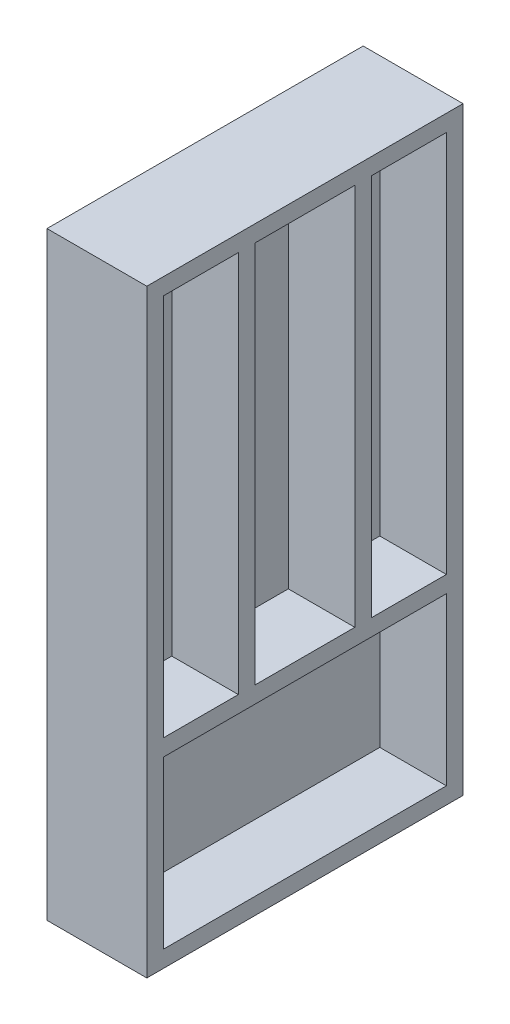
ISO-10303-21;
HEADER;
FILE_DESCRIPTION(('STEP AP214'),'2;1');
FILE_NAME('part.step','',(''),(''),'','','');
FILE_SCHEMA(('AUTOMOTIVE_DESIGN { 1 0 10303 214 1 1 1 1 }'));
ENDSEC;
DATA;
#1=APPLICATION_CONTEXT('core data for automotive mechanical design processes');
#2=APPLICATION_PROTOCOL_DEFINITION('international standard','automotive_design',2000,#1);
#3=PRODUCT_CONTEXT('',#1,'mechanical');
#4=PRODUCT('Part','Part','',(#3));
#5=PRODUCT_RELATED_PRODUCT_CATEGORY('part','',(#4));
#6=PRODUCT_DEFINITION_FORMATION('','',#4);
#7=PRODUCT_DEFINITION_CONTEXT('part definition',#1,'design');
#8=PRODUCT_DEFINITION('design','',#6,#7);
#9=PRODUCT_DEFINITION_SHAPE('','',#8);
#10=(LENGTH_UNIT() NAMED_UNIT(*) SI_UNIT(.MILLI.,.METRE.));
#11=(NAMED_UNIT(*) PLANE_ANGLE_UNIT() SI_UNIT($,.RADIAN.));
#12=(NAMED_UNIT(*) SI_UNIT($,.STERADIAN.) SOLID_ANGLE_UNIT());
#13=UNCERTAINTY_MEASURE_WITH_UNIT(LENGTH_MEASURE(1.E-05),#10,'distance_accuracy_value','');
#14=(GEOMETRIC_REPRESENTATION_CONTEXT(3) GLOBAL_UNCERTAINTY_ASSIGNED_CONTEXT((#13)) GLOBAL_UNIT_ASSIGNED_CONTEXT((#10,
#11,#12)) REPRESENTATION_CONTEXT('',''));
#15=CARTESIAN_POINT('',(0.,0.,0.));
#16=DIRECTION('',(0.,0.,1.));
#17=DIRECTION('',(1.,0.,0.));
#18=AXIS2_PLACEMENT_3D('',#15,#16,#17);
#19=CARTESIAN_POINT('',(50.8,25.4,25.4));
#20=DIRECTION('',(0.,0.,-1.));
#21=DIRECTION('',(-1.,0.,0.));
#22=AXIS2_PLACEMENT_3D('',#19,#20,#21);
#23=PLANE('',#22);
#24=DIRECTION('',(-1.,0.,0.));
#25=VECTOR('',#24,1.);
#26=CARTESIAN_POINT('',(152.4,304.8,25.4));
#27=LINE('',#26,#25);
#28=CARTESIAN_POINT('',(152.4,304.8,25.4));
#29=VERTEX_POINT('',#28);
#30=CARTESIAN_POINT('',(50.8,304.8,25.4));
#31=VERTEX_POINT('',#30);
#32=EDGE_CURVE('E371',#29,#31,#27,.T.);
#33=ORIENTED_EDGE('',*,*,#32,.F.);
#34=DIRECTION('',(0.,1.,0.));
#35=VECTOR('',#34,1.);
#36=CARTESIAN_POINT('',(152.4,25.4,25.4));
#37=LINE('',#36,#35);
#38=CARTESIAN_POINT('',(152.4,889.,25.4));
#39=VERTEX_POINT('',#38);
#40=EDGE_CURVE('E110',#29,#39,#37,.T.);
#41=ORIENTED_EDGE('',*,*,#40,.T.);
#42=DIRECTION('',(1.,0.,0.));
#43=VECTOR('',#42,1.);
#44=CARTESIAN_POINT('',(50.8,889.,25.4));
#45=LINE('',#44,#43);
#46=CARTESIAN_POINT('',(50.8,889.,25.4));
#47=VERTEX_POINT('',#46);
#48=EDGE_CURVE('E279',#47,#39,#45,.T.);
#49=ORIENTED_EDGE('',*,*,#48,.F.);
#50=DIRECTION('',(0.,1.,0.));
#51=VECTOR('',#50,1.);
#52=CARTESIAN_POINT('',(50.8,25.4,25.4));
#53=LINE('',#52,#51);
#54=EDGE_CURVE('E271',#31,#47,#53,.T.);
#55=ORIENTED_EDGE('',*,*,#54,.F.);
#56=EDGE_LOOP('',(#33,#41,#49,#55));
#57=FACE_BOUND('',#56,.T.);
#58=ADVANCED_FACE('F87',(#57),#23,.F.);
#59=CARTESIAN_POINT('',(50.8,889.,457.2));
#60=DIRECTION('',(0.,0.,1.));
#61=DIRECTION('',(1.,0.,0.));
#62=AXIS2_PLACEMENT_3D('',#59,#60,#61);
#63=PLANE('',#62);
#64=DIRECTION('',(-1.,0.,0.));
#65=VECTOR('',#64,1.);
#66=CARTESIAN_POINT('',(152.4,304.8,457.2));
#67=LINE('',#66,#65);
#68=CARTESIAN_POINT('',(152.4,304.8,457.2));
#69=VERTEX_POINT('',#68);
#70=CARTESIAN_POINT('',(50.8,304.8,457.2));
#71=VERTEX_POINT('',#70);
#72=EDGE_CURVE('E367',#69,#71,#67,.T.);
#73=ORIENTED_EDGE('',*,*,#72,.T.);
#74=DIRECTION('',(0.,-1.,0.));
#75=VECTOR('',#74,1.);
#76=CARTESIAN_POINT('',(50.8,889.,457.2));
#77=LINE('',#76,#75);
#78=CARTESIAN_POINT('',(50.8,889.,457.2));
#79=VERTEX_POINT('',#78);
#80=EDGE_CURVE('E414',#79,#71,#77,.T.);
#81=ORIENTED_EDGE('',*,*,#80,.F.);
#82=DIRECTION('',(1.,0.,0.));
#83=VECTOR('',#82,1.);
#84=CARTESIAN_POINT('',(50.8,889.,457.2));
#85=LINE('',#84,#83);
#86=CARTESIAN_POINT('',(152.4,889.,457.2));
#87=VERTEX_POINT('',#86);
#88=EDGE_CURVE('E277',#79,#87,#85,.T.);
#89=ORIENTED_EDGE('',*,*,#88,.T.);
#90=DIRECTION('',(0.,-1.,0.));
#91=VECTOR('',#90,1.);
#92=CARTESIAN_POINT('',(152.4,889.,457.2));
#93=LINE('',#92,#91);
#94=EDGE_CURVE('E248',#87,#69,#93,.T.);
#95=ORIENTED_EDGE('',*,*,#94,.T.);
#96=EDGE_LOOP('',(#73,#81,#89,#95));
#97=FACE_BOUND('',#96,.T.);
#98=ADVANCED_FACE('F333',(#97),#63,.F.);
#99=CARTESIAN_POINT('',(50.8,889.,25.4));
#100=DIRECTION('',(0.,1.,0.));
#101=DIRECTION('',(0.,0.,1.));
#102=AXIS2_PLACEMENT_3D('',#99,#100,#101);
#103=PLANE('',#102);
#104=DIRECTION('',(-1.,0.,0.));
#105=VECTOR('',#104,1.);
#106=CARTESIAN_POINT('',(152.4,889.,317.5));
#107=LINE('',#106,#105);
#108=CARTESIAN_POINT('',(152.4,889.,317.5));
#109=VERTEX_POINT('',#108);
#110=CARTESIAN_POINT('',(50.8,889.,317.5));
#111=VERTEX_POINT('',#110);
#112=EDGE_CURVE('E242',#109,#111,#107,.T.);
#113=ORIENTED_EDGE('',*,*,#112,.T.);
#114=DIRECTION('',(0.,0.,1.));
#115=VECTOR('',#114,1.);
#116=CARTESIAN_POINT('',(50.8,889.,25.4));
#117=LINE('',#116,#115);
#118=CARTESIAN_POINT('',(50.8,889.,165.1));
#119=VERTEX_POINT('',#118);
#120=EDGE_CURVE('E413',#119,#111,#117,.T.);
#121=ORIENTED_EDGE('',*,*,#120,.F.);
#122=DIRECTION('',(-1.,0.,0.));
#123=VECTOR('',#122,1.);
#124=CARTESIAN_POINT('',(152.4,889.,165.1));
#125=LINE('',#124,#123);
#126=CARTESIAN_POINT('',(152.4,889.,165.1));
#127=VERTEX_POINT('',#126);
#128=EDGE_CURVE('E396',#127,#119,#125,.T.);
#129=ORIENTED_EDGE('',*,*,#128,.F.);
#130=DIRECTION('',(0.,0.,1.));
#131=VECTOR('',#130,1.);
#132=CARTESIAN_POINT('',(152.4,889.,25.4));
#133=LINE('',#132,#131);
#134=EDGE_CURVE('E249',#127,#109,#133,.T.);
#135=ORIENTED_EDGE('',*,*,#134,.T.);
#136=EDGE_LOOP('',(#113,#121,#129,#135));
#137=FACE_BOUND('',#136,.T.);
#138=ADVANCED_FACE('F340',(#137),#103,.F.);
#139=DIRECTION('',(-1.,0.,0.));
#140=VECTOR('',#139,1.);
#141=CARTESIAN_POINT('',(152.4,889.,139.7));
#142=LINE('',#141,#140);
#143=CARTESIAN_POINT('',(152.4,889.,139.7));
#144=VERTEX_POINT('',#143);
#145=CARTESIAN_POINT('',(50.8,889.,139.7));
#146=VERTEX_POINT('',#145);
#147=EDGE_CURVE('E404',#144,#146,#142,.T.);
#148=ORIENTED_EDGE('',*,*,#147,.T.);
#149=EDGE_CURVE('E409',#47,#146,#117,.T.);
#150=ORIENTED_EDGE('',*,*,#149,.F.);
#151=ORIENTED_EDGE('',*,*,#48,.T.);
#152=EDGE_CURVE('E252',#39,#144,#133,.T.);
#153=ORIENTED_EDGE('',*,*,#152,.T.);
#154=EDGE_LOOP('',(#148,#150,#151,#153));
#155=FACE_BOUND('',#154,.T.);
#156=ADVANCED_FACE('F455',(#155),#103,.F.);
#157=CARTESIAN_POINT('',(50.8,0.,0.));
#158=DIRECTION('',(1.,0.,0.));
#159=DIRECTION('',(0.,0.,-1.));
#160=AXIS2_PLACEMENT_3D('',#157,#158,#159);
#161=PLANE('',#160);
#162=ORIENTED_EDGE('',*,*,#149,.T.);
#163=DIRECTION('',(0.,1.,0.));
#164=VECTOR('',#163,1.);
#165=CARTESIAN_POINT('',(50.8,304.8,139.7));
#166=LINE('',#165,#164);
#167=CARTESIAN_POINT('',(50.8,304.8,139.7));
#168=VERTEX_POINT('',#167);
#169=EDGE_CURVE('E394',#168,#146,#166,.T.);
#170=ORIENTED_EDGE('',*,*,#169,.F.);
#171=DIRECTION('',(0.,0.,1.));
#172=VECTOR('',#171,1.);
#173=CARTESIAN_POINT('',(50.8,304.8,25.4));
#174=LINE('',#173,#172);
#175=EDGE_CURVE('E378',#31,#168,#174,.T.);
#176=ORIENTED_EDGE('',*,*,#175,.F.);
#177=ORIENTED_EDGE('',*,*,#54,.T.);
#178=EDGE_LOOP('',(#162,#170,#176,#177));
#179=FACE_BOUND('',#178,.T.);
#180=ADVANCED_FACE('F453',(#179),#161,.T.);
#181=ORIENTED_EDGE('',*,*,#120,.T.);
#182=DIRECTION('',(0.,1.,0.));
#183=VECTOR('',#182,1.);
#184=CARTESIAN_POINT('',(50.8,304.8,317.5));
#185=LINE('',#184,#183);
#186=CARTESIAN_POINT('',(50.8,304.8,317.5));
#187=VERTEX_POINT('',#186);
#188=EDGE_CURVE('E233',#187,#111,#185,.T.);
#189=ORIENTED_EDGE('',*,*,#188,.F.);
#190=CARTESIAN_POINT('',(50.8,304.8,165.1));
#191=VERTEX_POINT('',#190);
#192=EDGE_CURVE('E382',#191,#187,#174,.T.);
#193=ORIENTED_EDGE('',*,*,#192,.F.);
#194=DIRECTION('',(0.,1.,0.));
#195=VECTOR('',#194,1.);
#196=CARTESIAN_POINT('',(50.8,304.8,165.1));
#197=LINE('',#196,#195);
#198=EDGE_CURVE('E397',#191,#119,#197,.T.);
#199=ORIENTED_EDGE('',*,*,#198,.T.);
#200=EDGE_LOOP('',(#181,#189,#193,#199));
#201=FACE_BOUND('',#200,.T.);
#202=ADVANCED_FACE('F464',(#201),#161,.T.);
#203=DIRECTION('',(0.,0.,1.));
#204=VECTOR('',#203,1.);
#205=CARTESIAN_POINT('',(50.8,279.4,25.4));
#206=LINE('',#205,#204);
#207=CARTESIAN_POINT('',(50.8,279.4,25.4));
#208=VERTEX_POINT('',#207);
#209=CARTESIAN_POINT('',(50.8,279.4,457.2));
#210=VERTEX_POINT('',#209);
#211=EDGE_CURVE('E381',#208,#210,#206,.T.);
#212=ORIENTED_EDGE('',*,*,#211,.T.);
#213=CARTESIAN_POINT('',(50.8,25.3999999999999,457.2));
#214=VERTEX_POINT('',#213);
#215=EDGE_CURVE('E412',#210,#214,#77,.T.);
#216=ORIENTED_EDGE('',*,*,#215,.T.);
#217=DIRECTION('',(0.,0.,-1.));
#218=VECTOR('',#217,1.);
#219=CARTESIAN_POINT('',(50.8,25.3999999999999,457.2));
#220=LINE('',#219,#218);
#221=CARTESIAN_POINT('',(50.8,25.4,25.4));
#222=VERTEX_POINT('',#221);
#223=EDGE_CURVE('E281',#214,#222,#220,.T.);
#224=ORIENTED_EDGE('',*,*,#223,.T.);
#225=EDGE_CURVE('E407',#222,#208,#53,.T.);
#226=ORIENTED_EDGE('',*,*,#225,.T.);
#227=EDGE_LOOP('',(#212,#216,#224,#226));
#228=FACE_BOUND('',#227,.T.);
#229=ADVANCED_FACE('F331',(#228),#161,.T.);
#230=CARTESIAN_POINT('',(152.4,0.,0.));
#231=DIRECTION('',(0.,1.,0.));
#232=DIRECTION('',(0.,0.,1.));
#233=AXIS2_PLACEMENT_3D('',#230,#231,#232);
#234=PLANE('',#233);
#235=DIRECTION('',(0.,0.,-1.));
#236=VECTOR('',#235,1.);
#237=CARTESIAN_POINT('',(0.,0.,0.));
#238=LINE('',#237,#236);
#239=CARTESIAN_POINT('',(0.,-1.11022302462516E-13,482.6));
#240=VERTEX_POINT('',#239);
#241=CARTESIAN_POINT('',(0.,0.,0.));
#242=VERTEX_POINT('',#241);
#243=EDGE_CURVE('E274',#240,#242,#238,.T.);
#244=ORIENTED_EDGE('',*,*,#243,.T.);
#245=DIRECTION('',(-1.,0.,0.));
#246=VECTOR('',#245,1.);
#247=CARTESIAN_POINT('',(152.4,0.,0.));
#248=LINE('',#247,#246);
#249=CARTESIAN_POINT('',(152.4,0.,0.));
#250=VERTEX_POINT('',#249);
#251=EDGE_CURVE('E12',#250,#242,#248,.T.);
#252=ORIENTED_EDGE('',*,*,#251,.F.);
#253=DIRECTION('',(0.,0.,-1.));
#254=VECTOR('',#253,1.);
#255=CARTESIAN_POINT('',(152.4,0.,0.));
#256=LINE('',#255,#254);
#257=CARTESIAN_POINT('',(152.4,-1.11022302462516E-13,482.6));
#258=VERTEX_POINT('',#257);
#259=EDGE_CURVE('E282',#258,#250,#256,.T.);
#260=ORIENTED_EDGE('',*,*,#259,.F.);
#261=DIRECTION('',(-1.,0.,0.));
#262=VECTOR('',#261,1.);
#263=CARTESIAN_POINT('',(152.4,-1.11022302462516E-13,482.6));
#264=LINE('',#263,#262);
#265=EDGE_CURVE('E292',#258,#240,#264,.T.);
#266=ORIENTED_EDGE('',*,*,#265,.T.);
#267=EDGE_LOOP('',(#244,#252,#260,#266));
#268=FACE_BOUND('',#267,.T.);
#269=ADVANCED_FACE('F89',(#268),#234,.F.);
#270=CARTESIAN_POINT('',(152.4,0.,0.));
#271=DIRECTION('',(0.,0.,1.));
#272=DIRECTION('',(1.,0.,0.));
#273=AXIS2_PLACEMENT_3D('',#270,#271,#272);
#274=PLANE('',#273);
#275=DIRECTION('',(0.,1.,0.));
#276=VECTOR('',#275,1.);
#277=CARTESIAN_POINT('',(0.,0.,0.));
#278=LINE('',#277,#276);
#279=CARTESIAN_POINT('',(0.,914.4,0.));
#280=VERTEX_POINT('',#279);
#281=EDGE_CURVE('E295',#242,#280,#278,.T.);
#282=ORIENTED_EDGE('',*,*,#281,.T.);
#283=DIRECTION('',(-1.,0.,0.));
#284=VECTOR('',#283,1.);
#285=CARTESIAN_POINT('',(152.4,914.4,0.));
#286=LINE('',#285,#284);
#287=CARTESIAN_POINT('',(152.4,914.4,0.));
#288=VERTEX_POINT('',#287);
#289=EDGE_CURVE('E95',#288,#280,#286,.T.);
#290=ORIENTED_EDGE('',*,*,#289,.F.);
#291=DIRECTION('',(0.,1.,0.));
#292=VECTOR('',#291,1.);
#293=CARTESIAN_POINT('',(152.4,0.,0.));
#294=LINE('',#293,#292);
#295=EDGE_CURVE('E285',#250,#288,#294,.T.);
#296=ORIENTED_EDGE('',*,*,#295,.F.);
#297=ORIENTED_EDGE('',*,*,#251,.T.);
#298=EDGE_LOOP('',(#282,#290,#296,#297));
#299=FACE_BOUND('',#298,.T.);
#300=ADVANCED_FACE('F324',(#299),#274,.F.);
#301=CARTESIAN_POINT('',(152.4,914.4,0.));
#302=DIRECTION('',(0.,-1.,0.));
#303=DIRECTION('',(0.,0.,-1.));
#304=AXIS2_PLACEMENT_3D('',#301,#302,#303);
#305=PLANE('',#304);
#306=DIRECTION('',(0.,0.,1.));
#307=VECTOR('',#306,1.);
#308=CARTESIAN_POINT('',(0.,914.4,0.));
#309=LINE('',#308,#307);
#310=CARTESIAN_POINT('',(0.,914.4,482.6));
#311=VERTEX_POINT('',#310);
#312=EDGE_CURVE('E297',#280,#311,#309,.T.);
#313=ORIENTED_EDGE('',*,*,#312,.T.);
#314=DIRECTION('',(-1.,0.,0.));
#315=VECTOR('',#314,1.);
#316=CARTESIAN_POINT('',(152.4,914.4,482.6));
#317=LINE('',#316,#315);
#318=CARTESIAN_POINT('',(152.4,914.4,482.6));
#319=VERTEX_POINT('',#318);
#320=EDGE_CURVE('E302',#319,#311,#317,.T.);
#321=ORIENTED_EDGE('',*,*,#320,.F.);
#322=DIRECTION('',(0.,0.,1.));
#323=VECTOR('',#322,1.);
#324=CARTESIAN_POINT('',(152.4,914.4,0.));
#325=LINE('',#324,#323);
#326=EDGE_CURVE('E288',#288,#319,#325,.T.);
#327=ORIENTED_EDGE('',*,*,#326,.F.);
#328=ORIENTED_EDGE('',*,*,#289,.T.);
#329=EDGE_LOOP('',(#313,#321,#327,#328));
#330=FACE_BOUND('',#329,.T.);
#331=ADVANCED_FACE('F309',(#330),#305,.F.);
#332=CARTESIAN_POINT('',(152.4,-1.11022302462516E-13,482.6));
#333=DIRECTION('',(0.,0.,-1.));
#334=DIRECTION('',(-1.,0.,0.));
#335=AXIS2_PLACEMENT_3D('',#332,#333,#334);
#336=PLANE('',#335);
#337=DIRECTION('',(0.,-1.,0.));
#338=VECTOR('',#337,1.);
#339=CARTESIAN_POINT('',(0.,-1.11022302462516E-13,482.6));
#340=LINE('',#339,#338);
#341=EDGE_CURVE('E286',#311,#240,#340,.T.);
#342=ORIENTED_EDGE('',*,*,#341,.T.);
#343=ORIENTED_EDGE('',*,*,#265,.F.);
#344=DIRECTION('',(0.,-1.,0.));
#345=VECTOR('',#344,1.);
#346=CARTESIAN_POINT('',(152.4,-1.11022302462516E-13,482.6));
#347=LINE('',#346,#345);
#348=EDGE_CURVE('E290',#319,#258,#347,.T.);
#349=ORIENTED_EDGE('',*,*,#348,.F.);
#350=ORIENTED_EDGE('',*,*,#320,.T.);
#351=EDGE_LOOP('',(#342,#343,#349,#350));
#352=FACE_BOUND('',#351,.T.);
#353=ADVANCED_FACE('F318',(#352),#336,.F.);
#354=CARTESIAN_POINT('',(152.4,0.,0.));
#355=DIRECTION('',(-1.,0.,0.));
#356=DIRECTION('',(0.,0.,1.));
#357=AXIS2_PLACEMENT_3D('',#354,#355,#356);
#358=PLANE('',#357);
#359=ORIENTED_EDGE('',*,*,#40,.F.);
#360=DIRECTION('',(0.,0.,1.));
#361=VECTOR('',#360,1.);
#362=CARTESIAN_POINT('',(152.4,304.8,25.4));
#363=LINE('',#362,#361);
#364=CARTESIAN_POINT('',(152.4,304.8,139.7));
#365=VERTEX_POINT('',#364);
#366=EDGE_CURVE('E368',#29,#365,#363,.T.);
#367=ORIENTED_EDGE('',*,*,#366,.T.);
#368=DIRECTION('',(0.,1.,0.));
#369=VECTOR('',#368,1.);
#370=CARTESIAN_POINT('',(152.4,304.8,139.7));
#371=LINE('',#370,#369);
#372=EDGE_CURVE('E393',#365,#144,#371,.T.);
#373=ORIENTED_EDGE('',*,*,#372,.T.);
#374=ORIENTED_EDGE('',*,*,#152,.F.);
#375=EDGE_LOOP('',(#359,#367,#373,#374));
#376=FACE_BOUND('',#375,.T.);
#377=CARTESIAN_POINT('',(152.4,304.8,342.9));
#378=VERTEX_POINT('',#377);
#379=EDGE_CURVE('E376',#378,#69,#363,.T.);
#380=ORIENTED_EDGE('',*,*,#379,.T.);
#381=ORIENTED_EDGE('',*,*,#94,.F.);
#382=CARTESIAN_POINT('',(152.4,889.,342.9));
#383=VERTEX_POINT('',#382);
#384=EDGE_CURVE('E239',#383,#87,#133,.T.);
#385=ORIENTED_EDGE('',*,*,#384,.F.);
#386=DIRECTION('',(0.,1.,0.));
#387=VECTOR('',#386,1.);
#388=CARTESIAN_POINT('',(152.4,304.8,342.9));
#389=LINE('',#388,#387);
#390=EDGE_CURVE('E224',#378,#383,#389,.T.);
#391=ORIENTED_EDGE('',*,*,#390,.F.);
#392=EDGE_LOOP('',(#380,#381,#385,#391));
#393=FACE_BOUND('',#392,.T.);
#394=CARTESIAN_POINT('',(152.4,279.4,457.2));
#395=VERTEX_POINT('',#394);
#396=CARTESIAN_POINT('',(152.4,25.3999999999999,457.2));
#397=VERTEX_POINT('',#396);
#398=EDGE_CURVE('E258',#395,#397,#93,.T.);
#399=ORIENTED_EDGE('',*,*,#398,.F.);
#400=DIRECTION('',(0.,0.,1.));
#401=VECTOR('',#400,1.);
#402=CARTESIAN_POINT('',(152.4,279.4,25.4));
#403=LINE('',#402,#401);
#404=CARTESIAN_POINT('',(152.4,279.4,25.4));
#405=VERTEX_POINT('',#404);
#406=EDGE_CURVE('E365',#405,#395,#403,.T.);
#407=ORIENTED_EDGE('',*,*,#406,.F.);
#408=CARTESIAN_POINT('',(152.4,25.4,25.4));
#409=VERTEX_POINT('',#408);
#410=EDGE_CURVE('E250',#409,#405,#37,.T.);
#411=ORIENTED_EDGE('',*,*,#410,.F.);
#412=DIRECTION('',(0.,0.,-1.));
#413=VECTOR('',#412,1.);
#414=CARTESIAN_POINT('',(152.4,25.3999999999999,457.2));
#415=LINE('',#414,#413);
#416=EDGE_CURVE('E267',#397,#409,#415,.T.);
#417=ORIENTED_EDGE('',*,*,#416,.F.);
#418=EDGE_LOOP('',(#399,#407,#411,#417));
#419=FACE_BOUND('',#418,.T.);
#420=DIRECTION('',(0.,1.,0.));
#421=VECTOR('',#420,1.);
#422=CARTESIAN_POINT('',(152.4,304.8,317.5));
#423=LINE('',#422,#421);
#424=CARTESIAN_POINT('',(152.4,304.8,317.5));
#425=VERTEX_POINT('',#424);
#426=EDGE_CURVE('E232',#425,#109,#423,.T.);
#427=ORIENTED_EDGE('',*,*,#426,.T.);
#428=ORIENTED_EDGE('',*,*,#134,.F.);
#429=DIRECTION('',(0.,1.,0.));
#430=VECTOR('',#429,1.);
#431=CARTESIAN_POINT('',(152.4,304.8,165.1));
#432=LINE('',#431,#430);
#433=CARTESIAN_POINT('',(152.4,304.8,165.1));
#434=VERTEX_POINT('',#433);
#435=EDGE_CURVE('E391',#434,#127,#432,.T.);
#436=ORIENTED_EDGE('',*,*,#435,.F.);
#437=EDGE_CURVE('E374',#434,#425,#363,.T.);
#438=ORIENTED_EDGE('',*,*,#437,.T.);
#439=EDGE_LOOP('',(#427,#428,#436,#438));
#440=FACE_BOUND('',#439,.T.);
#441=ORIENTED_EDGE('',*,*,#259,.T.);
#442=ORIENTED_EDGE('',*,*,#295,.T.);
#443=ORIENTED_EDGE('',*,*,#326,.T.);
#444=ORIENTED_EDGE('',*,*,#348,.T.);
#445=EDGE_LOOP('',(#441,#442,#443,#444));
#446=FACE_BOUND('',#445,.T.);
#447=ADVANCED_FACE('F245',(#376,#393,#419,#440,#446),#358,.F.);
#448=CARTESIAN_POINT('',(0.,0.,0.));
#449=DIRECTION('',(-1.,0.,0.));
#450=DIRECTION('',(0.,0.,1.));
#451=AXIS2_PLACEMENT_3D('',#448,#449,#450);
#452=PLANE('',#451);
#453=ORIENTED_EDGE('',*,*,#243,.F.);
#454=ORIENTED_EDGE('',*,*,#341,.F.);
#455=ORIENTED_EDGE('',*,*,#312,.F.);
#456=ORIENTED_EDGE('',*,*,#281,.F.);
#457=EDGE_LOOP('',(#453,#454,#455,#456));
#458=FACE_BOUND('',#457,.T.);
#459=ADVANCED_FACE('F315',(#458),#452,.T.);
#460=ORIENTED_EDGE('',*,*,#410,.T.);
#461=DIRECTION('',(-1.,0.,0.));
#462=VECTOR('',#461,1.);
#463=CARTESIAN_POINT('',(152.4,279.4,25.4));
#464=LINE('',#463,#462);
#465=EDGE_CURVE('E360',#405,#208,#464,.T.);
#466=ORIENTED_EDGE('',*,*,#465,.T.);
#467=ORIENTED_EDGE('',*,*,#225,.F.);
#468=DIRECTION('',(1.,0.,0.));
#469=VECTOR('',#468,1.);
#470=CARTESIAN_POINT('',(50.8,25.4,25.4));
#471=LINE('',#470,#469);
#472=EDGE_CURVE('E272',#222,#409,#471,.T.);
#473=ORIENTED_EDGE('',*,*,#472,.T.);
#474=EDGE_LOOP('',(#460,#466,#467,#473));
#475=FACE_BOUND('',#474,.T.);
#476=ADVANCED_FACE('F335',(#475),#23,.F.);
#477=CARTESIAN_POINT('',(50.8,25.3999999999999,457.2));
#478=DIRECTION('',(0.,-1.,0.));
#479=DIRECTION('',(0.,0.,-1.));
#480=AXIS2_PLACEMENT_3D('',#477,#478,#479);
#481=PLANE('',#480);
#482=ORIENTED_EDGE('',*,*,#416,.T.);
#483=ORIENTED_EDGE('',*,*,#472,.F.);
#484=ORIENTED_EDGE('',*,*,#223,.F.);
#485=DIRECTION('',(1.,0.,0.));
#486=VECTOR('',#485,1.);
#487=CARTESIAN_POINT('',(50.8,25.3999999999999,457.2));
#488=LINE('',#487,#486);
#489=EDGE_CURVE('E275',#214,#397,#488,.T.);
#490=ORIENTED_EDGE('',*,*,#489,.T.);
#491=EDGE_LOOP('',(#482,#483,#484,#490));
#492=FACE_BOUND('',#491,.T.);
#493=ADVANCED_FACE('F347',(#492),#481,.F.);
#494=ORIENTED_EDGE('',*,*,#215,.F.);
#495=DIRECTION('',(-1.,0.,0.));
#496=VECTOR('',#495,1.);
#497=CARTESIAN_POINT('',(152.4,279.4,457.2));
#498=LINE('',#497,#496);
#499=EDGE_CURVE('E386',#395,#210,#498,.T.);
#500=ORIENTED_EDGE('',*,*,#499,.F.);
#501=ORIENTED_EDGE('',*,*,#398,.T.);
#502=ORIENTED_EDGE('',*,*,#489,.F.);
#503=EDGE_LOOP('',(#494,#500,#501,#502));
#504=FACE_BOUND('',#503,.T.);
#505=ADVANCED_FACE('F343',(#504),#63,.F.);
#506=CARTESIAN_POINT('',(50.8,889.,342.9));
#507=VERTEX_POINT('',#506);
#508=EDGE_CURVE('E241',#507,#79,#117,.T.);
#509=ORIENTED_EDGE('',*,*,#508,.F.);
#510=DIRECTION('',(-1.,0.,0.));
#511=VECTOR('',#510,1.);
#512=CARTESIAN_POINT('',(152.4,889.,342.9));
#513=LINE('',#512,#511);
#514=EDGE_CURVE('E227',#383,#507,#513,.T.);
#515=ORIENTED_EDGE('',*,*,#514,.F.);
#516=ORIENTED_EDGE('',*,*,#384,.T.);
#517=ORIENTED_EDGE('',*,*,#88,.F.);
#518=EDGE_LOOP('',(#509,#515,#516,#517));
#519=FACE_BOUND('',#518,.T.);
#520=ADVANCED_FACE('F237',(#519),#103,.F.);
#521=DIRECTION('',(0.,1.,0.));
#522=VECTOR('',#521,1.);
#523=CARTESIAN_POINT('',(50.8,304.8,342.9));
#524=LINE('',#523,#522);
#525=CARTESIAN_POINT('',(50.8,304.8,342.9));
#526=VERTEX_POINT('',#525);
#527=EDGE_CURVE('E102',#526,#507,#524,.T.);
#528=ORIENTED_EDGE('',*,*,#527,.T.);
#529=ORIENTED_EDGE('',*,*,#508,.T.);
#530=ORIENTED_EDGE('',*,*,#80,.T.);
#531=EDGE_CURVE('E383',#526,#71,#174,.T.);
#532=ORIENTED_EDGE('',*,*,#531,.F.);
#533=EDGE_LOOP('',(#528,#529,#530,#532));
#534=FACE_BOUND('',#533,.T.);
#535=ADVANCED_FACE('F449',(#534),#161,.T.);
#536=CARTESIAN_POINT('',(152.4,304.8,317.5));
#537=DIRECTION('',(0.,0.,1.));
#538=DIRECTION('',(1.,0.,0.));
#539=AXIS2_PLACEMENT_3D('',#536,#537,#538);
#540=PLANE('',#539);
#541=ORIENTED_EDGE('',*,*,#188,.T.);
#542=ORIENTED_EDGE('',*,*,#112,.F.);
#543=ORIENTED_EDGE('',*,*,#426,.F.);
#544=DIRECTION('',(-1.,0.,0.));
#545=VECTOR('',#544,1.);
#546=CARTESIAN_POINT('',(152.4,304.8,317.5));
#547=LINE('',#546,#545);
#548=EDGE_CURVE('E473',#425,#187,#547,.T.);
#549=ORIENTED_EDGE('',*,*,#548,.T.);
#550=EDGE_LOOP('',(#541,#542,#543,#549));
#551=FACE_BOUND('',#550,.T.);
#552=ADVANCED_FACE('F451',(#551),#540,.F.);
#553=CARTESIAN_POINT('',(152.4,304.8,342.9));
#554=DIRECTION('',(0.,0.,1.));
#555=DIRECTION('',(1.,0.,0.));
#556=AXIS2_PLACEMENT_3D('',#553,#554,#555);
#557=PLANE('',#556);
#558=ORIENTED_EDGE('',*,*,#527,.F.);
#559=DIRECTION('',(-1.,0.,0.));
#560=VECTOR('',#559,1.);
#561=CARTESIAN_POINT('',(152.4,304.8,342.9));
#562=LINE('',#561,#560);
#563=EDGE_CURVE('E228',#378,#526,#562,.T.);
#564=ORIENTED_EDGE('',*,*,#563,.F.);
#565=ORIENTED_EDGE('',*,*,#390,.T.);
#566=ORIENTED_EDGE('',*,*,#514,.T.);
#567=EDGE_LOOP('',(#558,#564,#565,#566));
#568=FACE_BOUND('',#567,.T.);
#569=ADVANCED_FACE('F226',(#568),#557,.T.);
#570=CARTESIAN_POINT('',(152.4,304.8,139.7));
#571=DIRECTION('',(0.,0.,1.));
#572=DIRECTION('',(1.,0.,0.));
#573=AXIS2_PLACEMENT_3D('',#570,#571,#572);
#574=PLANE('',#573);
#575=ORIENTED_EDGE('',*,*,#169,.T.);
#576=ORIENTED_EDGE('',*,*,#147,.F.);
#577=ORIENTED_EDGE('',*,*,#372,.F.);
#578=DIRECTION('',(-1.,0.,0.));
#579=VECTOR('',#578,1.);
#580=CARTESIAN_POINT('',(152.4,304.8,139.7));
#581=LINE('',#580,#579);
#582=EDGE_CURVE('E402',#365,#168,#581,.T.);
#583=ORIENTED_EDGE('',*,*,#582,.T.);
#584=EDGE_LOOP('',(#575,#576,#577,#583));
#585=FACE_BOUND('',#584,.T.);
#586=ADVANCED_FACE('F434',(#585),#574,.F.);
#587=CARTESIAN_POINT('',(152.4,304.8,165.1));
#588=DIRECTION('',(0.,0.,1.));
#589=DIRECTION('',(1.,0.,0.));
#590=AXIS2_PLACEMENT_3D('',#587,#588,#589);
#591=PLANE('',#590);
#592=ORIENTED_EDGE('',*,*,#198,.F.);
#593=DIRECTION('',(-1.,0.,0.));
#594=VECTOR('',#593,1.);
#595=CARTESIAN_POINT('',(152.4,304.8,165.1));
#596=LINE('',#595,#594);
#597=EDGE_CURVE('E388',#434,#191,#596,.T.);
#598=ORIENTED_EDGE('',*,*,#597,.F.);
#599=ORIENTED_EDGE('',*,*,#435,.T.);
#600=ORIENTED_EDGE('',*,*,#128,.T.);
#601=EDGE_LOOP('',(#592,#598,#599,#600));
#602=FACE_BOUND('',#601,.T.);
#603=ADVANCED_FACE('F424',(#602),#591,.T.);
#604=CARTESIAN_POINT('',(152.4,279.4,25.4));
#605=DIRECTION('',(0.,-1.,0.));
#606=DIRECTION('',(0.,0.,-1.));
#607=AXIS2_PLACEMENT_3D('',#604,#605,#606);
#608=PLANE('',#607);
#609=ORIENTED_EDGE('',*,*,#211,.F.);
#610=ORIENTED_EDGE('',*,*,#465,.F.);
#611=ORIENTED_EDGE('',*,*,#406,.T.);
#612=ORIENTED_EDGE('',*,*,#499,.T.);
#613=EDGE_LOOP('',(#609,#610,#611,#612));
#614=FACE_BOUND('',#613,.T.);
#615=ADVANCED_FACE('F421',(#614),#608,.T.);
#616=CARTESIAN_POINT('',(152.4,304.8,25.4));
#617=DIRECTION('',(0.,-1.,0.));
#618=DIRECTION('',(0.,0.,-1.));
#619=AXIS2_PLACEMENT_3D('',#616,#617,#618);
#620=PLANE('',#619);
#621=ORIENTED_EDGE('',*,*,#582,.F.);
#622=ORIENTED_EDGE('',*,*,#366,.F.);
#623=ORIENTED_EDGE('',*,*,#32,.T.);
#624=ORIENTED_EDGE('',*,*,#175,.T.);
#625=EDGE_LOOP('',(#621,#622,#623,#624));
#626=FACE_BOUND('',#625,.T.);
#627=ADVANCED_FACE('F423',(#626),#620,.F.);
#628=ORIENTED_EDGE('',*,*,#192,.T.);
#629=ORIENTED_EDGE('',*,*,#548,.F.);
#630=ORIENTED_EDGE('',*,*,#437,.F.);
#631=ORIENTED_EDGE('',*,*,#597,.T.);
#632=EDGE_LOOP('',(#628,#629,#630,#631));
#633=FACE_BOUND('',#632,.T.);
#634=ADVANCED_FACE('F426',(#633),#620,.F.);
#635=ORIENTED_EDGE('',*,*,#379,.F.);
#636=ORIENTED_EDGE('',*,*,#563,.T.);
#637=ORIENTED_EDGE('',*,*,#531,.T.);
#638=ORIENTED_EDGE('',*,*,#72,.F.);
#639=EDGE_LOOP('',(#635,#636,#637,#638));
#640=FACE_BOUND('',#639,.T.);
#641=ADVANCED_FACE('F433',(#640),#620,.F.);
#642=CLOSED_SHELL('',(#58,#98,#138,#156,#180,#202,#229,#269,#300,#331,#353,#447,#459,#476,#493,
#505,#520,#535,#552,#569,#586,#603,#615,#627,#634,#641));
#643=MANIFOLD_SOLID_BREP('B2',#642);
#644=ADVANCED_BREP_SHAPE_REPRESENTATION('',(#18,#643),#14);
#645=SHAPE_DEFINITION_REPRESENTATION(#9,#644);
ENDSEC;
END-ISO-10303-21;
